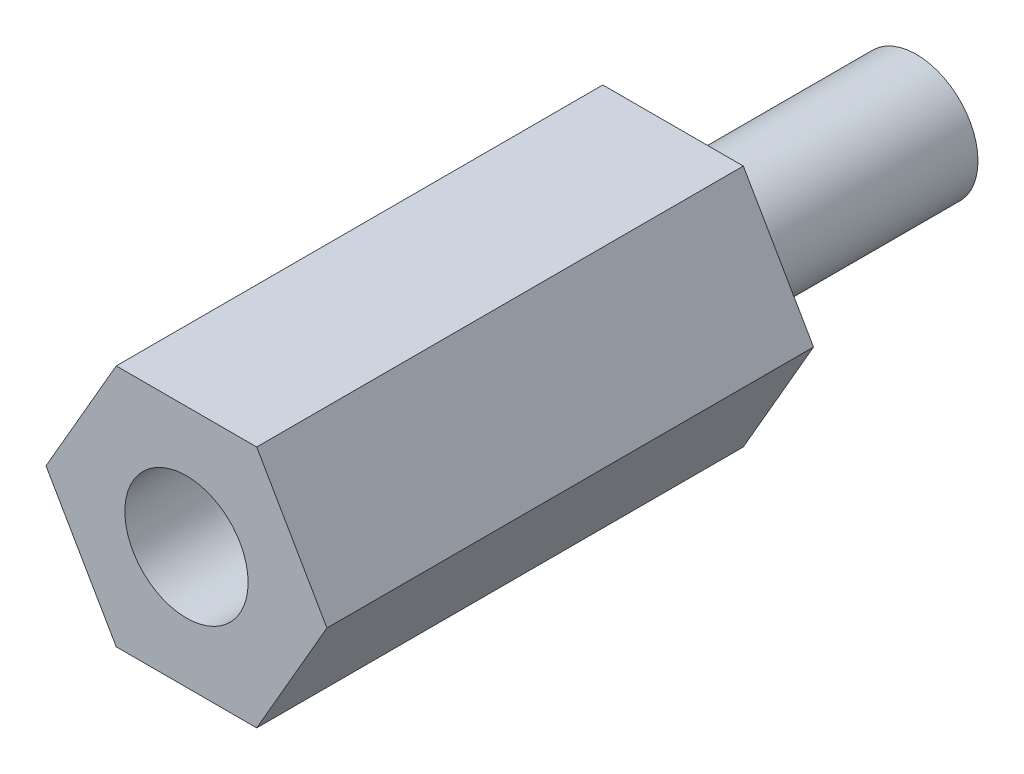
from build123d import *

# Parameters (mm, degrees)
BOSS_EXTRUDE1_DEPTH = 19.05
SKETCH2_R           = 2.413
BOSS_EXTRUDE2_DEPTH = 9.525
SKETCH3_R           = 2.413
CUT_EXTRUDE1_DEPTH  = 9.525


with BuildPart() as part:
    # Sketch1 → Boss-Extrude1 (new body)
    with BuildSketch(Plane.XY):
        Polygon((-2.749630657, -4.7625), (2.749630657, -4.7625), (5.499261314, 0), (2.749630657, 4.7625), (-2.749630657, 4.7625), (-5.499261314, 0), align=None)
    extrude(amount=BOSS_EXTRUDE1_DEPTH)

    # Sketch2 → Boss-Extrude2 (add)
    with BuildSketch(Plane(origin=(0, 0, 0), x_dir=(-1, 0, 0), z_dir=(0, 0, -1))):
        with Locations(Location((0, 0, 0), (0, 0, 180))):
            Circle(SKETCH2_R)
    extrude(amount=BOSS_EXTRUDE2_DEPTH)

    # Sketch3 → Cut-Extrude1 (cut)
    with BuildSketch(Plane.XY.offset(19.05)):
        Circle(SKETCH3_R)
    extrude(amount=-CUT_EXTRUDE1_DEPTH, mode=Mode.SUBTRACT)


solid = part.part
